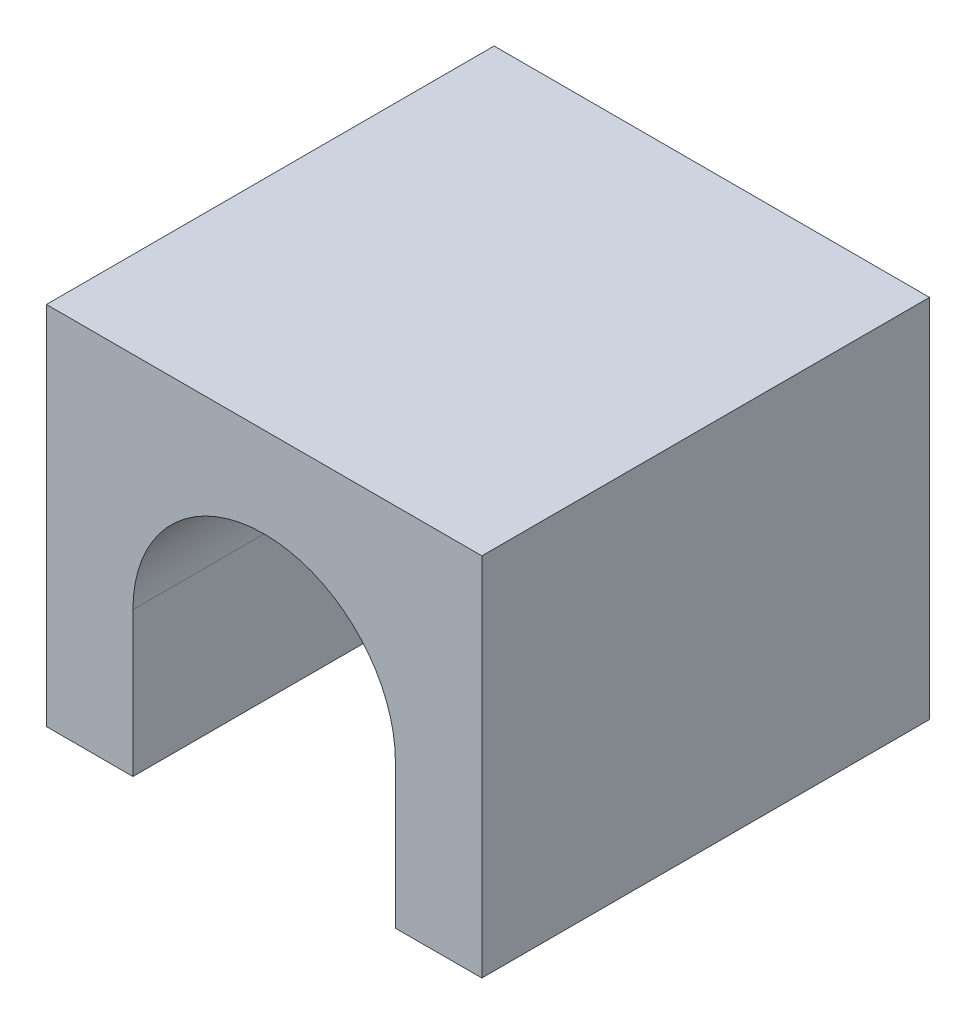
ISO-10303-21;
HEADER;
FILE_DESCRIPTION(('STEP AP214'),'2;1');
FILE_NAME('part.step','',(''),(''),'','','');
FILE_SCHEMA(('AUTOMOTIVE_DESIGN { 1 0 10303 214 1 1 1 1 }'));
ENDSEC;
DATA;
#1=APPLICATION_CONTEXT('core data for automotive mechanical design processes');
#2=APPLICATION_PROTOCOL_DEFINITION('international standard','automotive_design',2000,#1);
#3=PRODUCT_CONTEXT('',#1,'mechanical');
#4=PRODUCT('Part','Part','',(#3));
#5=PRODUCT_RELATED_PRODUCT_CATEGORY('part','',(#4));
#6=PRODUCT_DEFINITION_FORMATION('','',#4);
#7=PRODUCT_DEFINITION_CONTEXT('part definition',#1,'design');
#8=PRODUCT_DEFINITION('design','',#6,#7);
#9=PRODUCT_DEFINITION_SHAPE('','',#8);
#10=(LENGTH_UNIT() NAMED_UNIT(*) SI_UNIT(.MILLI.,.METRE.));
#11=(NAMED_UNIT(*) PLANE_ANGLE_UNIT() SI_UNIT($,.RADIAN.));
#12=(NAMED_UNIT(*) SI_UNIT($,.STERADIAN.) SOLID_ANGLE_UNIT());
#13=UNCERTAINTY_MEASURE_WITH_UNIT(LENGTH_MEASURE(1.E-05),#10,'distance_accuracy_value','');
#14=(GEOMETRIC_REPRESENTATION_CONTEXT(3) GLOBAL_UNCERTAINTY_ASSIGNED_CONTEXT((#13)) GLOBAL_UNIT_ASSIGNED_CONTEXT((#10,
#11,#12)) REPRESENTATION_CONTEXT('',''));
#15=CARTESIAN_POINT('',(0.,0.,0.));
#16=DIRECTION('',(0.,0.,1.));
#17=DIRECTION('',(1.,0.,0.));
#18=AXIS2_PLACEMENT_3D('',#15,#16,#17);
#19=CARTESIAN_POINT('',(4.01101098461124,-26.5115506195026,19.));
#20=DIRECTION('',(0.519436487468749,0.854509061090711,0.));
#21=DIRECTION('',(-0.854509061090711,0.519436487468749,0.));
#22=AXIS2_PLACEMENT_3D('',#19,#20,#21);
#23=PLANE('',#22);
#24=DIRECTION('',(0.854509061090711,-0.519436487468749,0.));
#25=VECTOR('',#24,1.);
#26=CARTESIAN_POINT('',(4.01101098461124,-26.5115506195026,0.));
#27=LINE('',#26,#25);
#28=CARTESIAN_POINT('',(4.01101098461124,-26.5115506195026,0.));
#29=VERTEX_POINT('',#28);
#30=CARTESIAN_POINT('',(4.07743578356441,-26.5519287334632,0.));
#31=VERTEX_POINT('',#30);
#32=EDGE_CURVE('E137',#29,#31,#27,.T.);
#33=ORIENTED_EDGE('',*,*,#32,.T.);
#34=DIRECTION('',(0.,0.,-1.));
#35=VECTOR('',#34,1.);
#36=CARTESIAN_POINT('',(4.07743578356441,-26.5519287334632,19.));
#37=LINE('',#36,#35);
#38=CARTESIAN_POINT('',(4.07743578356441,-26.5519287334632,19.));
#39=VERTEX_POINT('',#38);
#40=EDGE_CURVE('E36',#39,#31,#37,.T.);
#41=ORIENTED_EDGE('',*,*,#40,.F.);
#42=DIRECTION('',(0.854509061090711,-0.519436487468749,0.));
#43=VECTOR('',#42,1.);
#44=CARTESIAN_POINT('',(4.01101098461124,-26.5115506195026,19.));
#45=LINE('',#44,#43);
#46=CARTESIAN_POINT('',(4.04056164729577,-26.5295137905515,19.));
#47=VERTEX_POINT('',#46);
#48=EDGE_CURVE('E94',#47,#39,#45,.T.);
#49=ORIENTED_EDGE('',*,*,#48,.F.);
#50=CARTESIAN_POINT('',(4.01101098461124,-26.5115506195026,19.));
#51=VERTEX_POINT('',#50);
#52=EDGE_CURVE('E132',#51,#47,#45,.T.);
#53=ORIENTED_EDGE('',*,*,#52,.F.);
#54=DIRECTION('',(0.,0.,-1.));
#55=VECTOR('',#54,1.);
#56=CARTESIAN_POINT('',(4.01101098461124,-26.5115506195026,19.));
#57=LINE('',#56,#55);
#58=EDGE_CURVE('E56',#51,#29,#57,.T.);
#59=ORIENTED_EDGE('',*,*,#58,.T.);
#60=EDGE_LOOP('',(#33,#41,#49,#53,#59));
#61=FACE_BOUND('',#60,.T.);
#62=ADVANCED_FACE('F33',(#61),#23,.F.);
#63=CARTESIAN_POINT('',(4.07743578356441,-26.5519287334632,19.));
#64=DIRECTION('',(-0.0040647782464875,0.999991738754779,0.));
#65=DIRECTION('',(-0.999991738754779,-0.0040647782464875,0.));
#66=AXIS2_PLACEMENT_3D('',#63,#64,#65);
#67=PLANE('',#66);
#68=DIRECTION('',(0.999991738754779,0.0040647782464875,0.));
#69=VECTOR('',#68,1.);
#70=CARTESIAN_POINT('',(4.07743578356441,-26.5519287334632,0.));
#71=LINE('',#70,#69);
#72=CARTESIAN_POINT('',(14.0110109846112,-26.5115506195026,0.));
#73=VERTEX_POINT('',#72);
#74=EDGE_CURVE('E140',#31,#73,#71,.T.);
#75=ORIENTED_EDGE('',*,*,#74,.T.);
#76=DIRECTION('',(0.,0.,-1.));
#77=VECTOR('',#76,1.);
#78=CARTESIAN_POINT('',(14.0110109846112,-26.5115506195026,19.));
#79=LINE('',#78,#77);
#80=CARTESIAN_POINT('',(14.0110109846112,-26.5115506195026,19.));
#81=VERTEX_POINT('',#80);
#82=EDGE_CURVE('E166',#81,#73,#79,.T.);
#83=ORIENTED_EDGE('',*,*,#82,.F.);
#84=DIRECTION('',(0.999991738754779,0.0040647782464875,0.));
#85=VECTOR('',#84,1.);
#86=CARTESIAN_POINT('',(4.07743578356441,-26.5519287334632,19.));
#87=LINE('',#86,#85);
#88=EDGE_CURVE('E130',#39,#81,#87,.T.);
#89=ORIENTED_EDGE('',*,*,#88,.F.);
#90=ORIENTED_EDGE('',*,*,#40,.T.);
#91=EDGE_LOOP('',(#75,#83,#89,#90));
#92=FACE_BOUND('',#91,.T.);
#93=ADVANCED_FACE('F175',(#92),#67,.F.);
#94=CARTESIAN_POINT('',(14.0110109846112,20.8530101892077,19.));
#95=DIRECTION('',(-1.,0.,0.));
#96=DIRECTION('',(0.,0.,1.));
#97=AXIS2_PLACEMENT_3D('',#94,#95,#96);
#98=PLANE('',#97);
#99=DIRECTION('',(0.,1.,0.));
#100=VECTOR('',#99,1.);
#101=CARTESIAN_POINT('',(14.0110109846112,20.8530101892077,0.));
#102=LINE('',#101,#100);
#103=CARTESIAN_POINT('',(14.0110109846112,20.8530101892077,0.));
#104=VERTEX_POINT('',#103);
#105=EDGE_CURVE('E143',#73,#104,#102,.T.);
#106=ORIENTED_EDGE('',*,*,#105,.T.);
#107=DIRECTION('',(0.,0.,-1.));
#108=VECTOR('',#107,1.);
#109=CARTESIAN_POINT('',(14.0110109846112,20.8530101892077,19.));
#110=LINE('',#109,#108);
#111=CARTESIAN_POINT('',(14.0110109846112,20.8530101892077,58.));
#112=VERTEX_POINT('',#111);
#113=EDGE_CURVE('E164',#112,#104,#110,.T.);
#114=ORIENTED_EDGE('',*,*,#113,.F.);
#115=DIRECTION('',(0.,1.,0.));
#116=VECTOR('',#115,1.);
#117=CARTESIAN_POINT('',(14.0110109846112,20.8530101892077,58.));
#118=LINE('',#117,#116);
#119=CARTESIAN_POINT('',(14.0110109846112,-26.5115506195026,58.));
#120=VERTEX_POINT('',#119);
#121=EDGE_CURVE('E200',#120,#112,#118,.T.);
#122=ORIENTED_EDGE('',*,*,#121,.F.);
#123=DIRECTION('',(0.,0.,-1.));
#124=VECTOR('',#123,1.);
#125=CARTESIAN_POINT('',(14.0110109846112,-26.5115506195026,58.));
#126=LINE('',#125,#124);
#127=EDGE_CURVE('E237',#120,#81,#126,.T.);
#128=ORIENTED_EDGE('',*,*,#127,.T.);
#129=ORIENTED_EDGE('',*,*,#82,.T.);
#130=EDGE_LOOP('',(#106,#114,#122,#128,#129));
#131=FACE_BOUND('',#130,.T.);
#132=ADVANCED_FACE('F183',(#131),#98,.F.);
#133=CARTESIAN_POINT('',(-42.4008414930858,20.8530101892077,19.));
#134=DIRECTION('',(0.,-1.,0.));
#135=DIRECTION('',(0.,0.,-1.));
#136=AXIS2_PLACEMENT_3D('',#133,#134,#135);
#137=PLANE('',#136);
#138=DIRECTION('',(-1.,0.,0.));
#139=VECTOR('',#138,1.);
#140=CARTESIAN_POINT('',(-42.4008414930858,20.8530101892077,0.));
#141=LINE('',#140,#139);
#142=CARTESIAN_POINT('',(-42.4008414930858,20.8530101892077,0.));
#143=VERTEX_POINT('',#142);
#144=EDGE_CURVE('E145',#104,#143,#141,.T.);
#145=ORIENTED_EDGE('',*,*,#144,.T.);
#146=DIRECTION('',(0.,0.,-1.));
#147=VECTOR('',#146,1.);
#148=CARTESIAN_POINT('',(-42.4008414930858,20.8530101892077,19.));
#149=LINE('',#148,#147);
#150=CARTESIAN_POINT('',(-42.4008414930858,20.8530101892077,58.));
#151=VERTEX_POINT('',#150);
#152=EDGE_CURVE('E161',#151,#143,#149,.T.);
#153=ORIENTED_EDGE('',*,*,#152,.F.);
#154=DIRECTION('',(-1.,0.,0.));
#155=VECTOR('',#154,1.);
#156=CARTESIAN_POINT('',(-42.4008414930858,20.8530101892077,58.));
#157=LINE('',#156,#155);
#158=EDGE_CURVE('E192',#112,#151,#157,.T.);
#159=ORIENTED_EDGE('',*,*,#158,.F.);
#160=ORIENTED_EDGE('',*,*,#113,.T.);
#161=EDGE_LOOP('',(#145,#153,#159,#160));
#162=FACE_BOUND('',#161,.T.);
#163=ADVANCED_FACE('F189',(#162),#137,.F.);
#164=CARTESIAN_POINT('',(-42.4008414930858,20.8530101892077,19.));
#165=DIRECTION('',(1.,0.,0.));
#166=DIRECTION('',(0.,0.,-1.));
#167=AXIS2_PLACEMENT_3D('',#164,#165,#166);
#168=PLANE('',#167);
#169=DIRECTION('',(0.,-1.,0.));
#170=VECTOR('',#169,1.);
#171=CARTESIAN_POINT('',(-42.4008414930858,20.8530101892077,0.));
#172=LINE('',#171,#170);
#173=CARTESIAN_POINT('',(-42.4008414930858,-26.5115506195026,0.));
#174=VERTEX_POINT('',#173);
#175=EDGE_CURVE('E147',#143,#174,#172,.T.);
#176=ORIENTED_EDGE('',*,*,#175,.T.);
#177=DIRECTION('',(0.,0.,-1.));
#178=VECTOR('',#177,1.);
#179=CARTESIAN_POINT('',(-42.4008414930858,-26.5115506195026,19.));
#180=LINE('',#179,#178);
#181=CARTESIAN_POINT('',(-42.4008414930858,-26.5115506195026,58.));
#182=VERTEX_POINT('',#181);
#183=EDGE_CURVE('E158',#182,#174,#180,.T.);
#184=ORIENTED_EDGE('',*,*,#183,.F.);
#185=DIRECTION('',(0.,-1.,0.));
#186=VECTOR('',#185,1.);
#187=CARTESIAN_POINT('',(-42.4008414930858,-26.5115506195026,58.));
#188=LINE('',#187,#186);
#189=EDGE_CURVE('E199',#151,#182,#188,.T.);
#190=ORIENTED_EDGE('',*,*,#189,.F.);
#191=ORIENTED_EDGE('',*,*,#152,.T.);
#192=EDGE_LOOP('',(#176,#184,#190,#191));
#193=FACE_BOUND('',#192,.T.);
#194=ADVANCED_FACE('F309',(#193),#168,.F.);
#195=CARTESIAN_POINT('',(-32.4008414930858,-26.5115506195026,19.));
#196=DIRECTION('',(0.,1.,0.));
#197=DIRECTION('',(0.,0.,1.));
#198=AXIS2_PLACEMENT_3D('',#195,#196,#197);
#199=PLANE('',#198);
#200=DIRECTION('',(1.,0.,0.));
#201=VECTOR('',#200,1.);
#202=CARTESIAN_POINT('',(-32.4008414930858,-26.5115506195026,0.));
#203=LINE('',#202,#201);
#204=CARTESIAN_POINT('',(-32.4008414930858,-26.5115506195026,0.));
#205=VERTEX_POINT('',#204);
#206=EDGE_CURVE('E149',#174,#205,#203,.T.);
#207=ORIENTED_EDGE('',*,*,#206,.T.);
#208=DIRECTION('',(0.,0.,-1.));
#209=VECTOR('',#208,1.);
#210=CARTESIAN_POINT('',(-32.4008414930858,-26.5115506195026,19.));
#211=LINE('',#210,#209);
#212=CARTESIAN_POINT('',(-32.4008414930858,-26.5115506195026,19.));
#213=VERTEX_POINT('',#212);
#214=EDGE_CURVE('E116',#213,#205,#211,.T.);
#215=ORIENTED_EDGE('',*,*,#214,.F.);
#216=DIRECTION('',(1.,0.,0.));
#217=VECTOR('',#216,1.);
#218=CARTESIAN_POINT('',(-42.4008414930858,-26.5115506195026,19.));
#219=LINE('',#218,#217);
#220=CARTESIAN_POINT('',(-31.1949152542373,-26.5115506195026,19.));
#221=VERTEX_POINT('',#220);
#222=EDGE_CURVE('E129',#213,#221,#219,.T.);
#223=ORIENTED_EDGE('',*,*,#222,.T.);
#224=DIRECTION('',(0.,0.,-1.));
#225=VECTOR('',#224,1.);
#226=CARTESIAN_POINT('',(-31.1949152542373,-26.5115506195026,58.));
#227=LINE('',#226,#225);
#228=CARTESIAN_POINT('',(-31.1949152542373,-26.5115506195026,58.));
#229=VERTEX_POINT('',#228);
#230=EDGE_CURVE('E234',#229,#221,#227,.T.);
#231=ORIENTED_EDGE('',*,*,#230,.F.);
#232=DIRECTION('',(1.,0.,0.));
#233=VECTOR('',#232,1.);
#234=CARTESIAN_POINT('',(-42.4008414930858,-26.5115506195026,58.));
#235=LINE('',#234,#233);
#236=EDGE_CURVE('E202',#182,#229,#235,.T.);
#237=ORIENTED_EDGE('',*,*,#236,.F.);
#238=ORIENTED_EDGE('',*,*,#183,.T.);
#239=EDGE_LOOP('',(#207,#215,#223,#231,#237,#238));
#240=FACE_BOUND('',#239,.T.);
#241=ADVANCED_FACE('F285',(#240),#199,.F.);
#242=CARTESIAN_POINT('',(-33.3347249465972,-7.78601694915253,19.));
#243=DIRECTION('',(-0.998758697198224,-0.0498102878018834,0.));
#244=DIRECTION('',(0.0498102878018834,-0.998758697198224,0.));
#245=AXIS2_PLACEMENT_3D('',#242,#243,#244);
#246=PLANE('',#245);
#247=DIRECTION('',(-0.0498102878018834,0.998758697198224,0.));
#248=VECTOR('',#247,1.);
#249=CARTESIAN_POINT('',(-33.3347249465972,-7.78601694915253,0.));
#250=LINE('',#249,#248);
#251=CARTESIAN_POINT('',(-33.3347249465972,-7.78601694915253,0.));
#252=VERTEX_POINT('',#251);
#253=EDGE_CURVE('E113',#205,#252,#250,.T.);
#254=ORIENTED_EDGE('',*,*,#253,.T.);
#255=DIRECTION('',(0.,0.,-1.));
#256=VECTOR('',#255,1.);
#257=CARTESIAN_POINT('',(-33.3347249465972,-7.78601694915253,19.));
#258=LINE('',#257,#256);
#259=CARTESIAN_POINT('',(-33.3347249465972,-7.78601694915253,19.));
#260=VERTEX_POINT('',#259);
#261=EDGE_CURVE('E105',#260,#252,#258,.T.);
#262=ORIENTED_EDGE('',*,*,#261,.F.);
#263=DIRECTION('',(-0.0498102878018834,0.998758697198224,0.));
#264=VECTOR('',#263,1.);
#265=CARTESIAN_POINT('',(-33.3347249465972,-7.78601694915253,19.));
#266=LINE('',#265,#264);
#267=EDGE_CURVE('E110',#213,#260,#266,.T.);
#268=ORIENTED_EDGE('',*,*,#267,.F.);
#269=ORIENTED_EDGE('',*,*,#214,.T.);
#270=EDGE_LOOP('',(#254,#262,#268,#269));
#271=FACE_BOUND('',#270,.T.);
#272=ADVANCED_FACE('F107',(#271),#246,.F.);
#273=CARTESIAN_POINT('',(-14.661856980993,-7.8198884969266,19.));
#274=DIRECTION('',(0.,0.,-1.));
#275=DIRECTION('',(-1.,0.,0.));
#276=AXIS2_PLACEMENT_3D('',#273,#274,#275);
#277=CYLINDRICAL_SURFACE('',#276,18.6728986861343);
#278=CARTESIAN_POINT('',(-14.661856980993,-7.8198884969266,0.));
#279=DIRECTION('',(0.,0.,-1.));
#280=DIRECTION('',(1.,0.,0.));
#281=AXIS2_PLACEMENT_3D('',#278,#279,#280);
#282=CIRCLE('',#281,18.6728986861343);
#283=CARTESIAN_POINT('',(4.01101098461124,-7.78601694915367,0.));
#284=VERTEX_POINT('',#283);
#285=EDGE_CURVE('E152',#252,#284,#282,.T.);
#286=ORIENTED_EDGE('',*,*,#285,.T.);
#287=DIRECTION('',(0.,0.,-1.));
#288=VECTOR('',#287,1.);
#289=CARTESIAN_POINT('',(4.01101098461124,-7.78601694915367,19.));
#290=LINE('',#289,#288);
#291=CARTESIAN_POINT('',(4.01101098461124,-7.78601694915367,19.));
#292=VERTEX_POINT('',#291);
#293=EDGE_CURVE('E117',#292,#284,#290,.T.);
#294=ORIENTED_EDGE('',*,*,#293,.F.);
#295=CARTESIAN_POINT('',(-14.661856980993,-7.8198884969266,19.));
#296=DIRECTION('',(0.,0.,-1.));
#297=DIRECTION('',(1.,0.,0.));
#298=AXIS2_PLACEMENT_3D('',#295,#296,#297);
#299=CIRCLE('',#298,18.6728986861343);
#300=EDGE_CURVE('E120',#260,#292,#299,.T.);
#301=ORIENTED_EDGE('',*,*,#300,.F.);
#302=ORIENTED_EDGE('',*,*,#261,.T.);
#303=EDGE_LOOP('',(#286,#294,#301,#302));
#304=FACE_BOUND('',#303,.T.);
#305=ADVANCED_FACE('F121',(#304),#277,.F.);
#306=CARTESIAN_POINT('',(4.01101098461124,-7.78601694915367,19.));
#307=DIRECTION('',(1.,0.,0.));
#308=DIRECTION('',(0.,1.,0.));
#309=AXIS2_PLACEMENT_3D('',#306,#307,#308);
#310=PLANE('',#309);
#311=DIRECTION('',(0.,-1.,0.));
#312=VECTOR('',#311,1.);
#313=CARTESIAN_POINT('',(4.01101098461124,-7.78601694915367,0.));
#314=LINE('',#313,#312);
#315=EDGE_CURVE('E91',#284,#29,#314,.T.);
#316=ORIENTED_EDGE('',*,*,#315,.T.);
#317=ORIENTED_EDGE('',*,*,#58,.F.);
#318=DIRECTION('',(0.,-1.,0.));
#319=VECTOR('',#318,1.);
#320=CARTESIAN_POINT('',(4.01101098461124,-7.78601694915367,19.));
#321=LINE('',#320,#319);
#322=EDGE_CURVE('E124',#292,#51,#321,.T.);
#323=ORIENTED_EDGE('',*,*,#322,.F.);
#324=ORIENTED_EDGE('',*,*,#293,.T.);
#325=EDGE_LOOP('',(#316,#317,#323,#324));
#326=FACE_BOUND('',#325,.T.);
#327=ADVANCED_FACE('F287',(#326),#310,.F.);
#328=CARTESIAN_POINT('',(-14.661856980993,-7.8198884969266,19.));
#329=DIRECTION('',(0.,0.,1.));
#330=DIRECTION('',(1.,0.,0.));
#331=AXIS2_PLACEMENT_3D('',#328,#329,#330);
#332=PLANE('',#331);
#333=DIRECTION('',(0.999998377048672,0.00180163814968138,0.));
#334=VECTOR('',#333,1.);
#335=CARTESIAN_POINT('',(14.0110109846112,-26.5115506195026,19.));
#336=LINE('',#335,#334);
#337=EDGE_CURVE('E11',#47,#81,#336,.T.);
#338=ORIENTED_EDGE('',*,*,#337,.F.);
#339=ORIENTED_EDGE('',*,*,#48,.T.);
#340=ORIENTED_EDGE('',*,*,#88,.T.);
#341=EDGE_LOOP('',(#338,#339,#340));
#342=FACE_BOUND('',#341,.T.);
#343=ADVANCED_FACE('F289',(#342),#332,.T.);
#344=CARTESIAN_POINT('',(-14.661856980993,-7.8198884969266,0.));
#345=DIRECTION('',(0.,0.,1.));
#346=DIRECTION('',(1.,0.,0.));
#347=AXIS2_PLACEMENT_3D('',#344,#345,#346);
#348=PLANE('',#347);
#349=ORIENTED_EDGE('',*,*,#32,.F.);
#350=ORIENTED_EDGE('',*,*,#315,.F.);
#351=ORIENTED_EDGE('',*,*,#285,.F.);
#352=ORIENTED_EDGE('',*,*,#253,.F.);
#353=ORIENTED_EDGE('',*,*,#206,.F.);
#354=ORIENTED_EDGE('',*,*,#175,.F.);
#355=ORIENTED_EDGE('',*,*,#144,.F.);
#356=ORIENTED_EDGE('',*,*,#105,.F.);
#357=ORIENTED_EDGE('',*,*,#74,.F.);
#358=EDGE_LOOP('',(#349,#350,#351,#352,#353,#354,#355,#356,#357));
#359=FACE_BOUND('',#358,.T.);
#360=ADVANCED_FACE('F179',(#359),#348,.F.);
#361=CARTESIAN_POINT('',(-14.1949152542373,-7.78601694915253,19.));
#362=DIRECTION('',(0.,0.,1.));
#363=DIRECTION('',(1.,0.,0.));
#364=AXIS2_PLACEMENT_3D('',#361,#362,#363);
#365=PLANE('',#364);
#366=ORIENTED_EDGE('',*,*,#322,.T.);
#367=ORIENTED_EDGE('',*,*,#52,.T.);
#368=CARTESIAN_POINT('',(2.80508474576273,-26.5317396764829,19.));
#369=VERTEX_POINT('',#368);
#370=EDGE_CURVE('E42',#369,#47,#336,.T.);
#371=ORIENTED_EDGE('',*,*,#370,.F.);
#372=DIRECTION('',(0.,-1.,0.));
#373=VECTOR('',#372,1.);
#374=CARTESIAN_POINT('',(2.80508474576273,-7.78601694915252,19.));
#375=LINE('',#374,#373);
#376=CARTESIAN_POINT('',(2.80508474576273,-7.78601694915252,19.));
#377=VERTEX_POINT('',#376);
#378=EDGE_CURVE('E225',#377,#369,#375,.T.);
#379=ORIENTED_EDGE('',*,*,#378,.F.);
#380=CARTESIAN_POINT('',(-14.1949152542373,-7.78601694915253,19.));
#381=DIRECTION('',(0.,0.,-1.));
#382=DIRECTION('',(1.,0.,0.));
#383=AXIS2_PLACEMENT_3D('',#380,#381,#382);
#384=CIRCLE('',#383,17.);
#385=CARTESIAN_POINT('',(-31.1949152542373,-7.78601694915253,19.));
#386=VERTEX_POINT('',#385);
#387=EDGE_CURVE('E222',#386,#377,#384,.T.);
#388=ORIENTED_EDGE('',*,*,#387,.F.);
#389=DIRECTION('',(0.,1.,0.));
#390=VECTOR('',#389,1.);
#391=CARTESIAN_POINT('',(-31.1949152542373,-7.78601694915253,19.));
#392=LINE('',#391,#390);
#393=EDGE_CURVE('E219',#221,#386,#392,.T.);
#394=ORIENTED_EDGE('',*,*,#393,.F.);
#395=ORIENTED_EDGE('',*,*,#222,.F.);
#396=ORIENTED_EDGE('',*,*,#267,.T.);
#397=ORIENTED_EDGE('',*,*,#300,.T.);
#398=EDGE_LOOP('',(#366,#367,#371,#379,#388,#394,#395,#396,#397));
#399=FACE_BOUND('',#398,.T.);
#400=ADVANCED_FACE('F126',(#399),#365,.F.);
#401=CARTESIAN_POINT('',(14.0110109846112,-26.5115506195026,58.));
#402=DIRECTION('',(-0.00180163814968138,0.999998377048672,0.));
#403=DIRECTION('',(-0.999998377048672,-0.00180163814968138,0.));
#404=AXIS2_PLACEMENT_3D('',#401,#402,#403);
#405=PLANE('',#404);
#406=ORIENTED_EDGE('',*,*,#370,.T.);
#407=ORIENTED_EDGE('',*,*,#337,.T.);
#408=ORIENTED_EDGE('',*,*,#127,.F.);
#409=DIRECTION('',(0.999998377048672,0.00180163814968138,0.));
#410=VECTOR('',#409,1.);
#411=CARTESIAN_POINT('',(14.0110109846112,-26.5115506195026,58.));
#412=LINE('',#411,#410);
#413=CARTESIAN_POINT('',(2.80508474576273,-26.5317396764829,58.));
#414=VERTEX_POINT('',#413);
#415=EDGE_CURVE('E204',#414,#120,#412,.T.);
#416=ORIENTED_EDGE('',*,*,#415,.F.);
#417=DIRECTION('',(0.,0.,-1.));
#418=VECTOR('',#417,1.);
#419=CARTESIAN_POINT('',(2.80508474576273,-26.5317396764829,58.));
#420=LINE('',#419,#418);
#421=EDGE_CURVE('E141',#414,#369,#420,.T.);
#422=ORIENTED_EDGE('',*,*,#421,.T.);
#423=EDGE_LOOP('',(#406,#407,#408,#416,#422));
#424=FACE_BOUND('',#423,.T.);
#425=ADVANCED_FACE('F245',(#424),#405,.F.);
#426=CARTESIAN_POINT('',(-31.1949152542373,-7.78601694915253,58.));
#427=DIRECTION('',(-1.,0.,0.));
#428=DIRECTION('',(0.,-1.,0.));
#429=AXIS2_PLACEMENT_3D('',#426,#427,#428);
#430=PLANE('',#429);
#431=ORIENTED_EDGE('',*,*,#393,.T.);
#432=DIRECTION('',(0.,0.,-1.));
#433=VECTOR('',#432,1.);
#434=CARTESIAN_POINT('',(-31.1949152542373,-7.78601694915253,58.));
#435=LINE('',#434,#433);
#436=CARTESIAN_POINT('',(-31.1949152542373,-7.78601694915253,58.));
#437=VERTEX_POINT('',#436);
#438=EDGE_CURVE('E231',#437,#386,#435,.T.);
#439=ORIENTED_EDGE('',*,*,#438,.F.);
#440=DIRECTION('',(0.,1.,0.));
#441=VECTOR('',#440,1.);
#442=CARTESIAN_POINT('',(-31.1949152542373,-26.5115506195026,58.));
#443=LINE('',#442,#441);
#444=EDGE_CURVE('E210',#229,#437,#443,.T.);
#445=ORIENTED_EDGE('',*,*,#444,.F.);
#446=ORIENTED_EDGE('',*,*,#230,.T.);
#447=EDGE_LOOP('',(#431,#439,#445,#446));
#448=FACE_BOUND('',#447,.T.);
#449=ADVANCED_FACE('F274',(#448),#430,.F.);
#450=CARTESIAN_POINT('',(-14.1949152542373,-7.78601694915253,58.));
#451=DIRECTION('',(0.,0.,-1.));
#452=DIRECTION('',(-1.,0.,0.));
#453=AXIS2_PLACEMENT_3D('',#450,#451,#452);
#454=CYLINDRICAL_SURFACE('',#453,17.);
#455=ORIENTED_EDGE('',*,*,#387,.T.);
#456=DIRECTION('',(0.,0.,-1.));
#457=VECTOR('',#456,1.);
#458=CARTESIAN_POINT('',(2.80508474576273,-7.78601694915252,58.));
#459=LINE('',#458,#457);
#460=CARTESIAN_POINT('',(2.80508474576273,-7.78601694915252,58.));
#461=VERTEX_POINT('',#460);
#462=EDGE_CURVE('E215',#461,#377,#459,.T.);
#463=ORIENTED_EDGE('',*,*,#462,.F.);
#464=CARTESIAN_POINT('',(-14.1949152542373,-7.78601694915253,58.));
#465=DIRECTION('',(0.,0.,-1.));
#466=DIRECTION('',(1.,0.,0.));
#467=AXIS2_PLACEMENT_3D('',#464,#465,#466);
#468=CIRCLE('',#467,17.);
#469=EDGE_CURVE('E213',#437,#461,#468,.T.);
#470=ORIENTED_EDGE('',*,*,#469,.F.);
#471=ORIENTED_EDGE('',*,*,#438,.T.);
#472=EDGE_LOOP('',(#455,#463,#470,#471));
#473=FACE_BOUND('',#472,.T.);
#474=ADVANCED_FACE('F280',(#473),#454,.F.);
#475=CARTESIAN_POINT('',(2.80508474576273,-7.78601694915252,58.));
#476=DIRECTION('',(1.,0.,0.));
#477=DIRECTION('',(0.,1.,0.));
#478=AXIS2_PLACEMENT_3D('',#475,#476,#477);
#479=PLANE('',#478);
#480=ORIENTED_EDGE('',*,*,#378,.T.);
#481=ORIENTED_EDGE('',*,*,#421,.F.);
#482=DIRECTION('',(0.,-1.,0.));
#483=VECTOR('',#482,1.);
#484=CARTESIAN_POINT('',(2.80508474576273,-26.5317396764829,58.));
#485=LINE('',#484,#483);
#486=EDGE_CURVE('E228',#461,#414,#485,.T.);
#487=ORIENTED_EDGE('',*,*,#486,.F.);
#488=ORIENTED_EDGE('',*,*,#462,.T.);
#489=EDGE_LOOP('',(#480,#481,#487,#488));
#490=FACE_BOUND('',#489,.T.);
#491=ADVANCED_FACE('F256',(#490),#479,.F.);
#492=CARTESIAN_POINT('',(-14.1949152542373,-7.78601694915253,58.));
#493=DIRECTION('',(0.,0.,1.));
#494=DIRECTION('',(1.,0.,0.));
#495=AXIS2_PLACEMENT_3D('',#492,#493,#494);
#496=PLANE('',#495);
#497=ORIENTED_EDGE('',*,*,#486,.T.);
#498=ORIENTED_EDGE('',*,*,#415,.T.);
#499=ORIENTED_EDGE('',*,*,#121,.T.);
#500=ORIENTED_EDGE('',*,*,#158,.T.);
#501=ORIENTED_EDGE('',*,*,#189,.T.);
#502=ORIENTED_EDGE('',*,*,#236,.T.);
#503=ORIENTED_EDGE('',*,*,#444,.T.);
#504=ORIENTED_EDGE('',*,*,#469,.T.);
#505=EDGE_LOOP('',(#497,#498,#499,#500,#501,#502,#503,#504));
#506=FACE_BOUND('',#505,.T.);
#507=ADVANCED_FACE('F282',(#506),#496,.T.);
#508=CLOSED_SHELL('',(#62,#93,#132,#163,#194,#241,#272,#305,#327,#343,#360,#400,#425,#449,#474,
#491,#507));
#509=MANIFOLD_SOLID_BREP('B2',#508);
#510=ADVANCED_BREP_SHAPE_REPRESENTATION('',(#18,#509),#14);
#511=SHAPE_DEFINITION_REPRESENTATION(#9,#510);
ENDSEC;
END-ISO-10303-21;
